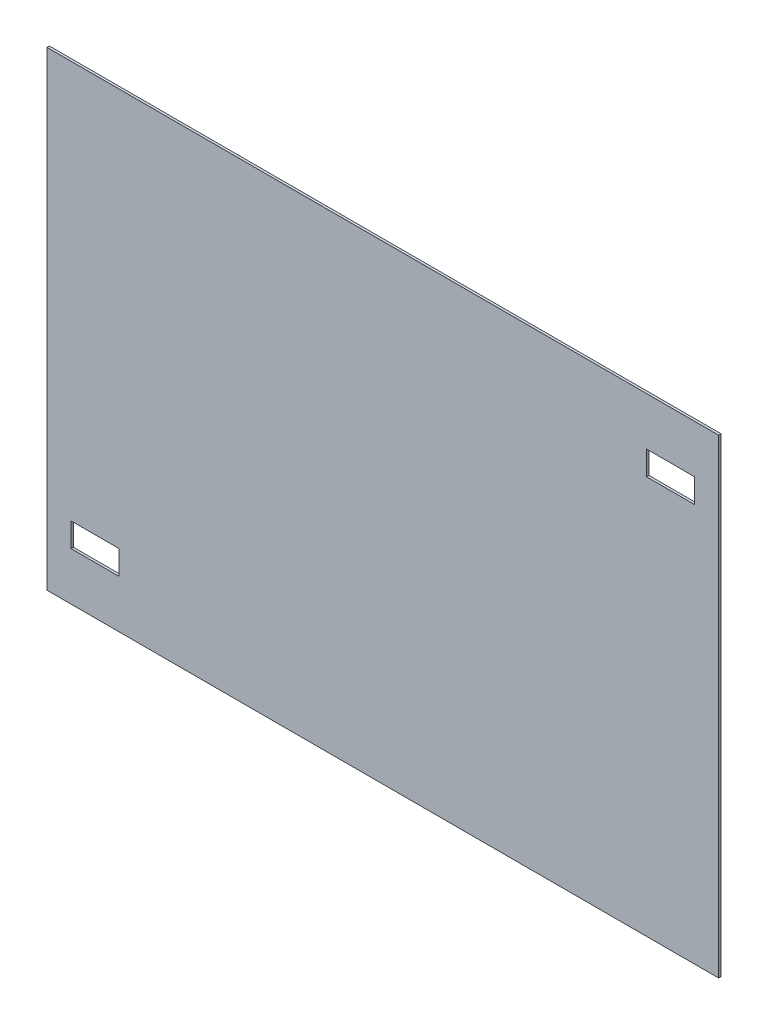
from build123d import *

# Parameters (mm, degrees)
SKETCH1_W           = 2794
SKETCH1_H           = 1955.8
BOSS_EXTRUDE1_DEPTH = 10
SKETCH2_W           = 200
SKETCH2_H           = 100
CUT_EXTRUDE1_DEPTH  = 3411.526299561


with BuildPart() as part:
    # Sketch1 → Boss-Extrude1 (new body)
    with BuildSketch(Plane.XY):
        with Locations((1397, 977.9)):
            Rectangle(SKETCH1_W, SKETCH1_H)
    extrude(amount=BOSS_EXTRUDE1_DEPTH)

    # Sketch2 → Cut-Extrude1 (cut, through all)
    with BuildSketch(Plane.XY.offset(10)):
        with Locations((200, 250)):
            Rectangle(SKETCH2_W, SKETCH2_H)
        with Locations((2594, 1705.8)):
            Rectangle(SKETCH2_W, SKETCH2_H)
    extrude(amount=-CUT_EXTRUDE1_DEPTH, mode=Mode.SUBTRACT)


solid = part.part
